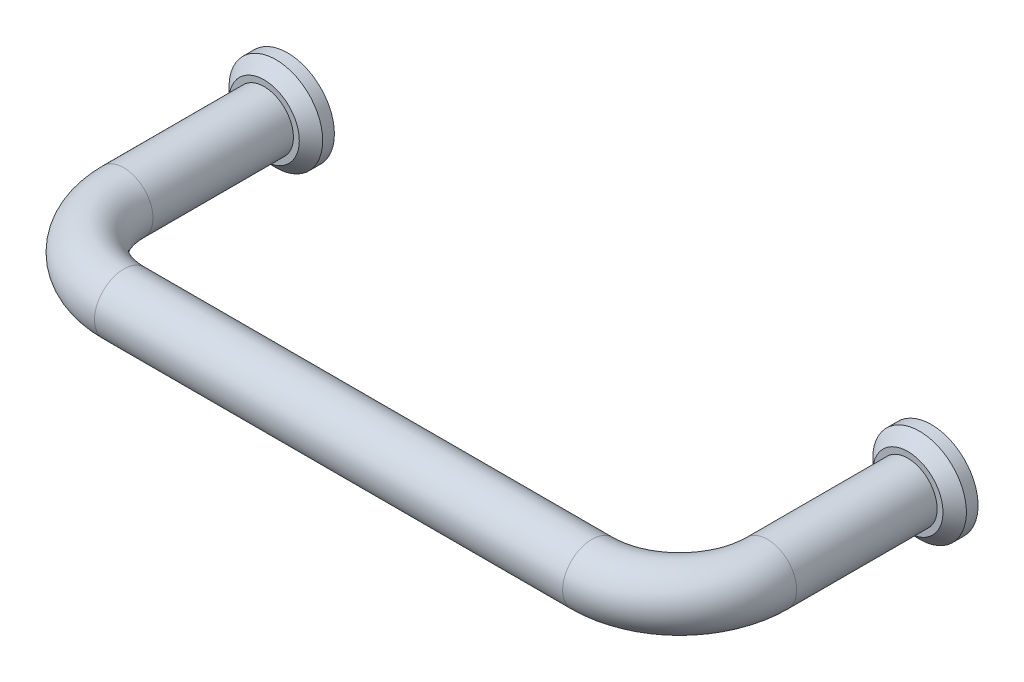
ISO-10303-21;
HEADER;
FILE_DESCRIPTION(('STEP AP214'),'2;1');
FILE_NAME('part.step','',(''),(''),'','','');
FILE_SCHEMA(('AUTOMOTIVE_DESIGN { 1 0 10303 214 1 1 1 1 }'));
ENDSEC;
DATA;
#1=APPLICATION_CONTEXT('core data for automotive mechanical design processes');
#2=APPLICATION_PROTOCOL_DEFINITION('international standard','automotive_design',2000,#1);
#3=PRODUCT_CONTEXT('',#1,'mechanical');
#4=PRODUCT('Part','Part','',(#3));
#5=PRODUCT_RELATED_PRODUCT_CATEGORY('part','',(#4));
#6=PRODUCT_DEFINITION_FORMATION('','',#4);
#7=PRODUCT_DEFINITION_CONTEXT('part definition',#1,'design');
#8=PRODUCT_DEFINITION('design','',#6,#7);
#9=PRODUCT_DEFINITION_SHAPE('','',#8);
#10=(LENGTH_UNIT() NAMED_UNIT(*) SI_UNIT(.MILLI.,.METRE.));
#11=(NAMED_UNIT(*) PLANE_ANGLE_UNIT() SI_UNIT($,.RADIAN.));
#12=(NAMED_UNIT(*) SI_UNIT($,.STERADIAN.) SOLID_ANGLE_UNIT());
#13=UNCERTAINTY_MEASURE_WITH_UNIT(LENGTH_MEASURE(1.E-05),#10,'distance_accuracy_value','');
#14=(GEOMETRIC_REPRESENTATION_CONTEXT(3) GLOBAL_UNCERTAINTY_ASSIGNED_CONTEXT((#13)) GLOBAL_UNIT_ASSIGNED_CONTEXT((#10,
#11,#12)) REPRESENTATION_CONTEXT('',''));
#15=CARTESIAN_POINT('',(0.,0.,0.));
#16=DIRECTION('',(0.,0.,1.));
#17=DIRECTION('',(1.,0.,0.));
#18=AXIS2_PLACEMENT_3D('',#15,#16,#17);
#19=CARTESIAN_POINT('',(0.,0.,0.));
#20=DIRECTION('',(0.,0.,-1.));
#21=DIRECTION('',(0.,1.,0.));
#22=AXIS2_PLACEMENT_3D('',#19,#20,#21);
#23=PLANE('',#22);
#24=CARTESIAN_POINT('',(0.,0.,0.));
#25=DIRECTION('',(0.,0.,1.));
#26=DIRECTION('',(1.,0.,0.));
#27=AXIS2_PLACEMENT_3D('',#24,#25,#26);
#28=CIRCLE('',#27,4.);
#29=CARTESIAN_POINT('',(4.,0.,0.));
#30=VERTEX_POINT('',#29);
#31=EDGE_CURVE('E56',#30,#30,#28,.T.);
#32=ORIENTED_EDGE('',*,*,#31,.F.);
#33=EDGE_LOOP('',(#32));
#34=FACE_BOUND('',#33,.T.);
#35=CARTESIAN_POINT('',(0.,0.,0.));
#36=DIRECTION('',(0.,0.,1.));
#37=DIRECTION('',(0.,-1.,0.));
#38=AXIS2_PLACEMENT_3D('',#35,#36,#37);
#39=CIRCLE('',#38,1.5);
#40=CARTESIAN_POINT('',(0.,-1.5,0.));
#41=VERTEX_POINT('',#40);
#42=EDGE_CURVE('E62',#41,#41,#39,.T.);
#43=ORIENTED_EDGE('',*,*,#42,.T.);
#44=EDGE_LOOP('',(#43));
#45=FACE_BOUND('',#44,.T.);
#46=ADVANCED_FACE('F12',(#34,#45),#23,.T.);
#47=CARTESIAN_POINT('',(0.,0.,14.));
#48=DIRECTION('',(0.,0.,-1.));
#49=DIRECTION('',(0.,-1.,0.));
#50=AXIS2_PLACEMENT_3D('',#47,#48,#49);
#51=CYLINDRICAL_SURFACE('',#50,2.5);
#52=CARTESIAN_POINT('',(0.,0.,14.));
#53=DIRECTION('',(0.,0.,-1.));
#54=DIRECTION('',(0.,1.,0.));
#55=AXIS2_PLACEMENT_3D('',#52,#53,#54);
#56=CIRCLE('',#55,2.5);
#57=CARTESIAN_POINT('',(-2.5,0.,14.));
#58=VERTEX_POINT('',#57);
#59=EDGE_CURVE('E20',#58,#58,#56,.T.);
#60=ORIENTED_EDGE('',*,*,#59,.T.);
#61=EDGE_LOOP('',(#60));
#62=FACE_BOUND('',#61,.T.);
#63=CARTESIAN_POINT('',(0.,0.,2.));
#64=DIRECTION('',(0.,0.,-1.));
#65=DIRECTION('',(-1.,0.,0.));
#66=AXIS2_PLACEMENT_3D('',#63,#64,#65);
#67=CIRCLE('',#66,2.5);
#68=CARTESIAN_POINT('',(-2.5,0.,2.));
#69=VERTEX_POINT('',#68);
#70=EDGE_CURVE('E16',#69,#69,#67,.F.);
#71=ORIENTED_EDGE('',*,*,#70,.T.);
#72=EDGE_LOOP('',(#71));
#73=FACE_BOUND('',#72,.T.);
#74=ADVANCED_FACE('F14',(#62,#73),#51,.T.);
#75=CARTESIAN_POINT('',(55.,0.,14.));
#76=DIRECTION('',(0.,0.,-1.));
#77=DIRECTION('',(-1.,0.,0.));
#78=AXIS2_PLACEMENT_3D('',#75,#76,#77);
#79=CYLINDRICAL_SURFACE('',#78,2.5);
#80=CARTESIAN_POINT('',(55.,0.,14.));
#81=DIRECTION('',(0.,0.,1.));
#82=DIRECTION('',(0.,1.,0.));
#83=AXIS2_PLACEMENT_3D('',#80,#81,#82);
#84=CIRCLE('',#83,2.5);
#85=CARTESIAN_POINT('',(57.5,0.,14.));
#86=VERTEX_POINT('',#85);
#87=EDGE_CURVE('E32',#86,#86,#84,.T.);
#88=ORIENTED_EDGE('',*,*,#87,.F.);
#89=EDGE_LOOP('',(#88));
#90=FACE_BOUND('',#89,.T.);
#91=CARTESIAN_POINT('',(55.,0.,2.));
#92=DIRECTION('',(0.,0.,-1.));
#93=DIRECTION('',(-1.,0.,0.));
#94=AXIS2_PLACEMENT_3D('',#91,#92,#93);
#95=CIRCLE('',#94,2.5);
#96=CARTESIAN_POINT('',(52.5,0.,2.));
#97=VERTEX_POINT('',#96);
#98=EDGE_CURVE('E8',#97,#97,#95,.T.);
#99=ORIENTED_EDGE('',*,*,#98,.F.);
#100=EDGE_LOOP('',(#99));
#101=FACE_BOUND('',#100,.T.);
#102=ADVANCED_FACE('F91',(#90,#101),#79,.T.);
#103=CARTESIAN_POINT('',(7.5,0.,14.));
#104=DIRECTION('',(0.,-1.,0.));
#105=DIRECTION('',(1.,0.,0.));
#106=AXIS2_PLACEMENT_3D('',#103,#104,#105);
#107=TOROIDAL_SURFACE('',#106,7.5,2.5);
#108=CARTESIAN_POINT('',(7.5,0.,21.5));
#109=DIRECTION('',(-1.,0.,0.));
#110=DIRECTION('',(0.,1.,0.));
#111=AXIS2_PLACEMENT_3D('',#108,#109,#110);
#112=CIRCLE('',#111,2.5);
#113=CARTESIAN_POINT('',(7.5,0.,24.));
#114=VERTEX_POINT('',#113);
#115=EDGE_CURVE('E24',#114,#114,#112,.T.);
#116=CARTESIAN_POINT('',(7.5,0.,14.));
#117=DIRECTION('',(0.,-1.,0.));
#118=DIRECTION('',(1.,0.,0.));
#119=AXIS2_PLACEMENT_3D('',#116,#117,#118);
#120=CIRCLE('',#119,10.);
#121=EDGE_CURVE('',#114,#58,#120,.T.);
#122=ORIENTED_EDGE('',*,*,#115,.T.);
#123=ORIENTED_EDGE('',*,*,#59,.F.);
#124=ORIENTED_EDGE('',*,*,#121,.T.);
#125=ORIENTED_EDGE('',*,*,#121,.F.);
#126=EDGE_LOOP('',(#122,#124,#123,#125));
#127=FACE_BOUND('',#126,.T.);
#128=ADVANCED_FACE('F100',(#127),#107,.T.);
#129=CARTESIAN_POINT('',(47.5,0.,21.5));
#130=DIRECTION('',(-1.,0.,0.));
#131=DIRECTION('',(0.,-1.,0.));
#132=AXIS2_PLACEMENT_3D('',#129,#130,#131);
#133=CYLINDRICAL_SURFACE('',#132,2.5);
#134=CARTESIAN_POINT('',(47.5,0.,21.5));
#135=DIRECTION('',(-1.,0.,0.));
#136=DIRECTION('',(0.,1.,0.));
#137=AXIS2_PLACEMENT_3D('',#134,#135,#136);
#138=CIRCLE('',#137,2.5);
#139=CARTESIAN_POINT('',(47.5,0.,24.));
#140=VERTEX_POINT('',#139);
#141=EDGE_CURVE('E29',#140,#140,#138,.T.);
#142=ORIENTED_EDGE('',*,*,#141,.T.);
#143=EDGE_LOOP('',(#142));
#144=FACE_BOUND('',#143,.T.);
#145=ORIENTED_EDGE('',*,*,#115,.F.);
#146=EDGE_LOOP('',(#145));
#147=FACE_BOUND('',#146,.T.);
#148=ADVANCED_FACE('F106',(#144,#147),#133,.T.);
#149=CARTESIAN_POINT('',(47.5,0.,14.));
#150=DIRECTION('',(0.,-1.,0.));
#151=DIRECTION('',(1.,0.,0.));
#152=AXIS2_PLACEMENT_3D('',#149,#150,#151);
#153=TOROIDAL_SURFACE('',#152,7.5,2.5);
#154=CARTESIAN_POINT('',(47.5,0.,14.));
#155=DIRECTION('',(0.,-1.,0.));
#156=DIRECTION('',(1.,0.,0.));
#157=AXIS2_PLACEMENT_3D('',#154,#155,#156);
#158=CIRCLE('',#157,10.);
#159=EDGE_CURVE('',#86,#140,#158,.T.);
#160=ORIENTED_EDGE('',*,*,#87,.T.);
#161=ORIENTED_EDGE('',*,*,#141,.F.);
#162=ORIENTED_EDGE('',*,*,#159,.T.);
#163=ORIENTED_EDGE('',*,*,#159,.F.);
#164=EDGE_LOOP('',(#160,#162,#161,#163));
#165=FACE_BOUND('',#164,.T.);
#166=ADVANCED_FACE('F102',(#165),#153,.T.);
#167=CARTESIAN_POINT('',(55.,0.,2.));
#168=DIRECTION('',(0.,0.,-1.));
#169=DIRECTION('',(-1.,0.,0.));
#170=AXIS2_PLACEMENT_3D('',#167,#168,#169);
#171=PLANE('',#170);
#172=CARTESIAN_POINT('',(55.,0.,2.));
#173=DIRECTION('',(0.,0.,-1.));
#174=DIRECTION('',(-1.,0.,0.));
#175=AXIS2_PLACEMENT_3D('',#172,#173,#174);
#176=CIRCLE('',#175,3.);
#177=CARTESIAN_POINT('',(52.,0.,2.));
#178=VERTEX_POINT('',#177);
#179=EDGE_CURVE('E35',#178,#178,#176,.T.);
#180=ORIENTED_EDGE('',*,*,#179,.F.);
#181=EDGE_LOOP('',(#180));
#182=FACE_BOUND('',#181,.T.);
#183=ORIENTED_EDGE('',*,*,#98,.T.);
#184=EDGE_LOOP('',(#183));
#185=FACE_BOUND('',#184,.T.);
#186=ADVANCED_FACE('F105',(#182,#185),#171,.F.);
#187=CARTESIAN_POINT('',(55.,0.,2.));
#188=DIRECTION('',(0.,0.,-1.));
#189=DIRECTION('',(-1.,0.,0.));
#190=AXIS2_PLACEMENT_3D('',#187,#188,#189);
#191=CONICAL_SURFACE('',#190,3.,0.785398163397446);
#192=CARTESIAN_POINT('',(55.,0.,1.));
#193=DIRECTION('',(0.,0.,-1.));
#194=DIRECTION('',(-1.,0.,0.));
#195=AXIS2_PLACEMENT_3D('',#192,#193,#194);
#196=CIRCLE('',#195,4.);
#197=CARTESIAN_POINT('',(51.,0.,1.));
#198=VERTEX_POINT('',#197);
#199=EDGE_CURVE('E38',#198,#198,#196,.T.);
#200=ORIENTED_EDGE('',*,*,#199,.F.);
#201=EDGE_LOOP('',(#200));
#202=FACE_BOUND('',#201,.T.);
#203=ORIENTED_EDGE('',*,*,#179,.T.);
#204=EDGE_LOOP('',(#203));
#205=FACE_BOUND('',#204,.T.);
#206=ADVANCED_FACE('F146',(#202,#205),#191,.T.);
#207=CARTESIAN_POINT('',(55.,0.,0.));
#208=DIRECTION('',(0.,0.,-1.));
#209=DIRECTION('',(-1.,0.,0.));
#210=AXIS2_PLACEMENT_3D('',#207,#208,#209);
#211=CYLINDRICAL_SURFACE('',#210,4.);
#212=CARTESIAN_POINT('',(55.,0.,0.));
#213=DIRECTION('',(0.,0.,-1.));
#214=DIRECTION('',(-1.,0.,0.));
#215=AXIS2_PLACEMENT_3D('',#212,#213,#214);
#216=CIRCLE('',#215,4.);
#217=CARTESIAN_POINT('',(51.,0.,0.));
#218=VERTEX_POINT('',#217);
#219=EDGE_CURVE('E41',#218,#218,#216,.T.);
#220=ORIENTED_EDGE('',*,*,#219,.F.);
#221=EDGE_LOOP('',(#220));
#222=FACE_BOUND('',#221,.T.);
#223=ORIENTED_EDGE('',*,*,#199,.T.);
#224=EDGE_LOOP('',(#223));
#225=FACE_BOUND('',#224,.T.);
#226=ADVANCED_FACE('F143',(#222,#225),#211,.T.);
#227=CARTESIAN_POINT('',(55.,0.,0.));
#228=DIRECTION('',(0.,0.,1.));
#229=DIRECTION('',(0.,1.,0.));
#230=AXIS2_PLACEMENT_3D('',#227,#228,#229);
#231=PLANE('',#230);
#232=CARTESIAN_POINT('',(55.,0.,0.));
#233=DIRECTION('',(0.,0.,-1.));
#234=DIRECTION('',(0.,-1.,0.));
#235=AXIS2_PLACEMENT_3D('',#232,#233,#234);
#236=CIRCLE('',#235,1.5);
#237=CARTESIAN_POINT('',(55.,-1.5,0.));
#238=VERTEX_POINT('',#237);
#239=EDGE_CURVE('E47',#238,#238,#236,.T.);
#240=ORIENTED_EDGE('',*,*,#239,.F.);
#241=EDGE_LOOP('',(#240));
#242=FACE_BOUND('',#241,.T.);
#243=ORIENTED_EDGE('',*,*,#219,.T.);
#244=EDGE_LOOP('',(#243));
#245=FACE_BOUND('',#244,.T.);
#246=ADVANCED_FACE('F96',(#242,#245),#231,.F.);
#247=CARTESIAN_POINT('',(55.,0.,7.));
#248=DIRECTION('',(0.,0.,-1.));
#249=DIRECTION('',(0.,-1.,0.));
#250=AXIS2_PLACEMENT_3D('',#247,#248,#249);
#251=CYLINDRICAL_SURFACE('',#250,1.5);
#252=CARTESIAN_POINT('',(55.,0.,7.));
#253=DIRECTION('',(0.,0.,-1.));
#254=DIRECTION('',(0.,-1.,0.));
#255=AXIS2_PLACEMENT_3D('',#252,#253,#254);
#256=CIRCLE('',#255,1.5);
#257=CARTESIAN_POINT('',(55.,-1.5,7.));
#258=VERTEX_POINT('',#257);
#259=EDGE_CURVE('E44',#258,#258,#256,.T.);
#260=ORIENTED_EDGE('',*,*,#259,.F.);
#261=EDGE_LOOP('',(#260));
#262=FACE_BOUND('',#261,.T.);
#263=ORIENTED_EDGE('',*,*,#239,.T.);
#264=EDGE_LOOP('',(#263));
#265=FACE_BOUND('',#264,.T.);
#266=ADVANCED_FACE('F127',(#262,#265),#251,.F.);
#267=CARTESIAN_POINT('',(55.,0.,7.));
#268=DIRECTION('',(0.,0.,-1.));
#269=DIRECTION('',(0.,-1.,0.));
#270=AXIS2_PLACEMENT_3D('',#267,#268,#269);
#271=PLANE('',#270);
#272=ORIENTED_EDGE('',*,*,#259,.T.);
#273=EDGE_LOOP('',(#272));
#274=FACE_BOUND('',#273,.T.);
#275=ADVANCED_FACE('F125',(#274),#271,.T.);
#276=CARTESIAN_POINT('',(0.,0.,2.));
#277=DIRECTION('',(0.,0.,-1.));
#278=DIRECTION('',(1.,0.,0.));
#279=AXIS2_PLACEMENT_3D('',#276,#277,#278);
#280=PLANE('',#279);
#281=ORIENTED_EDGE('',*,*,#70,.F.);
#282=EDGE_LOOP('',(#281));
#283=FACE_BOUND('',#282,.T.);
#284=CARTESIAN_POINT('',(0.,0.,2.));
#285=DIRECTION('',(0.,0.,1.));
#286=DIRECTION('',(1.,0.,0.));
#287=AXIS2_PLACEMENT_3D('',#284,#285,#286);
#288=CIRCLE('',#287,3.);
#289=CARTESIAN_POINT('',(3.,0.,2.));
#290=VERTEX_POINT('',#289);
#291=EDGE_CURVE('E50',#290,#290,#288,.T.);
#292=ORIENTED_EDGE('',*,*,#291,.T.);
#293=EDGE_LOOP('',(#292));
#294=FACE_BOUND('',#293,.T.);
#295=ADVANCED_FACE('F122',(#283,#294),#280,.F.);
#296=CARTESIAN_POINT('',(0.,0.,2.));
#297=DIRECTION('',(0.,0.,-1.));
#298=DIRECTION('',(1.,0.,0.));
#299=AXIS2_PLACEMENT_3D('',#296,#297,#298);
#300=CONICAL_SURFACE('',#299,3.,0.785398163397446);
#301=CARTESIAN_POINT('',(0.,0.,1.));
#302=DIRECTION('',(0.,0.,1.));
#303=DIRECTION('',(1.,0.,0.));
#304=AXIS2_PLACEMENT_3D('',#301,#302,#303);
#305=CIRCLE('',#304,4.);
#306=CARTESIAN_POINT('',(4.,0.,1.));
#307=VERTEX_POINT('',#306);
#308=EDGE_CURVE('E53',#307,#307,#305,.T.);
#309=ORIENTED_EDGE('',*,*,#308,.T.);
#310=EDGE_LOOP('',(#309));
#311=FACE_BOUND('',#310,.T.);
#312=ORIENTED_EDGE('',*,*,#291,.F.);
#313=EDGE_LOOP('',(#312));
#314=FACE_BOUND('',#313,.T.);
#315=ADVANCED_FACE('F81',(#311,#314),#300,.T.);
#316=CARTESIAN_POINT('',(0.,0.,0.));
#317=DIRECTION('',(0.,0.,-1.));
#318=DIRECTION('',(1.,0.,0.));
#319=AXIS2_PLACEMENT_3D('',#316,#317,#318);
#320=CYLINDRICAL_SURFACE('',#319,4.);
#321=ORIENTED_EDGE('',*,*,#31,.T.);
#322=EDGE_LOOP('',(#321));
#323=FACE_BOUND('',#322,.T.);
#324=ORIENTED_EDGE('',*,*,#308,.F.);
#325=EDGE_LOOP('',(#324));
#326=FACE_BOUND('',#325,.T.);
#327=ADVANCED_FACE('F70',(#323,#326),#320,.T.);
#328=CARTESIAN_POINT('',(0.,0.,7.));
#329=DIRECTION('',(0.,0.,-1.));
#330=DIRECTION('',(0.,-1.,0.));
#331=AXIS2_PLACEMENT_3D('',#328,#329,#330);
#332=CYLINDRICAL_SURFACE('',#331,1.5);
#333=CARTESIAN_POINT('',(0.,0.,7.));
#334=DIRECTION('',(0.,0.,1.));
#335=DIRECTION('',(0.,-1.,0.));
#336=AXIS2_PLACEMENT_3D('',#333,#334,#335);
#337=CIRCLE('',#336,1.5);
#338=CARTESIAN_POINT('',(0.,-1.5,7.));
#339=VERTEX_POINT('',#338);
#340=EDGE_CURVE('E59',#339,#339,#337,.T.);
#341=ORIENTED_EDGE('',*,*,#340,.T.);
#342=EDGE_LOOP('',(#341));
#343=FACE_BOUND('',#342,.T.);
#344=ORIENTED_EDGE('',*,*,#42,.F.);
#345=EDGE_LOOP('',(#344));
#346=FACE_BOUND('',#345,.T.);
#347=ADVANCED_FACE('F67',(#343,#346),#332,.F.);
#348=CARTESIAN_POINT('',(0.,0.,7.));
#349=DIRECTION('',(0.,0.,-1.));
#350=DIRECTION('',(0.,-1.,0.));
#351=AXIS2_PLACEMENT_3D('',#348,#349,#350);
#352=PLANE('',#351);
#353=ORIENTED_EDGE('',*,*,#340,.F.);
#354=EDGE_LOOP('',(#353));
#355=FACE_BOUND('',#354,.T.);
#356=ADVANCED_FACE('F69',(#355),#352,.T.);
#357=CLOSED_SHELL('',(#46,#74,#102,#128,#148,#166,#186,#206,#226,#246,#266,#275,#295,#315,#327,
#347,#356));
#358=MANIFOLD_SOLID_BREP('B1',#357);
#359=ADVANCED_BREP_SHAPE_REPRESENTATION('',(#18,#358),#14);
#360=SHAPE_DEFINITION_REPRESENTATION(#9,#359);
ENDSEC;
END-ISO-10303-21;
